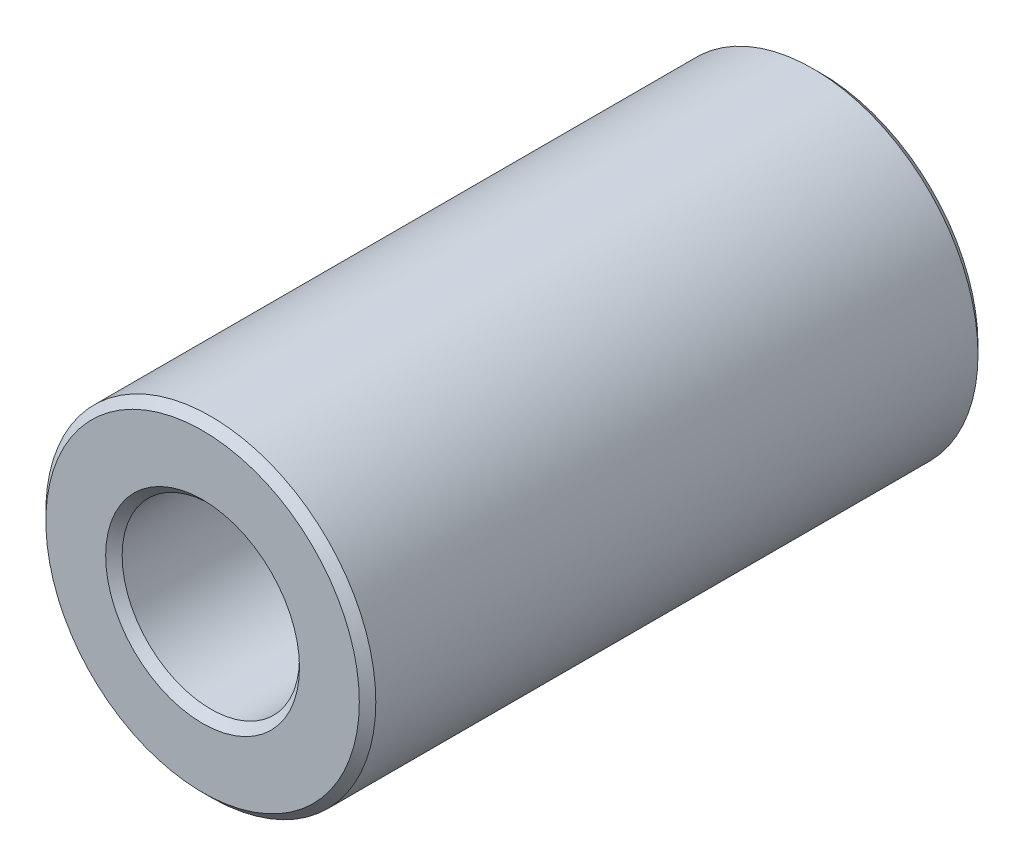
ISO-10303-21;
HEADER;
FILE_DESCRIPTION(('STEP AP214'),'2;1');
FILE_NAME('part.step','',(''),(''),'','','');
FILE_SCHEMA(('AUTOMOTIVE_DESIGN { 1 0 10303 214 1 1 1 1 }'));
ENDSEC;
DATA;
#1=APPLICATION_CONTEXT('core data for automotive mechanical design processes');
#2=APPLICATION_PROTOCOL_DEFINITION('international standard','automotive_design',2000,#1);
#3=PRODUCT_CONTEXT('',#1,'mechanical');
#4=PRODUCT('Part','Part','',(#3));
#5=PRODUCT_RELATED_PRODUCT_CATEGORY('part','',(#4));
#6=PRODUCT_DEFINITION_FORMATION('','',#4);
#7=PRODUCT_DEFINITION_CONTEXT('part definition',#1,'design');
#8=PRODUCT_DEFINITION('design','',#6,#7);
#9=PRODUCT_DEFINITION_SHAPE('','',#8);
#10=(LENGTH_UNIT() NAMED_UNIT(*) SI_UNIT(.MILLI.,.METRE.));
#11=(NAMED_UNIT(*) PLANE_ANGLE_UNIT() SI_UNIT($,.RADIAN.));
#12=(NAMED_UNIT(*) SI_UNIT($,.STERADIAN.) SOLID_ANGLE_UNIT());
#13=UNCERTAINTY_MEASURE_WITH_UNIT(LENGTH_MEASURE(1.E-05),#10,'distance_accuracy_value','');
#14=(GEOMETRIC_REPRESENTATION_CONTEXT(3) GLOBAL_UNCERTAINTY_ASSIGNED_CONTEXT((#13)) GLOBAL_UNIT_ASSIGNED_CONTEXT((#10,
#11,#12)) REPRESENTATION_CONTEXT('',''));
#15=CARTESIAN_POINT('',(0.,0.,0.));
#16=DIRECTION('',(0.,0.,1.));
#17=DIRECTION('',(1.,0.,0.));
#18=AXIS2_PLACEMENT_3D('',#15,#16,#17);
#19=CARTESIAN_POINT('',(0.,0.,7.5));
#20=DIRECTION('',(0.,0.,1.));
#21=DIRECTION('',(1.,0.,0.));
#22=AXIS2_PLACEMENT_3D('',#19,#20,#21);
#23=PLANE('',#22);
#24=CARTESIAN_POINT('',(0.,0.,7.5));
#25=DIRECTION('',(0.,0.,1.));
#26=DIRECTION('',(1.,0.,0.));
#27=AXIS2_PLACEMENT_3D('',#24,#25,#26);
#28=CIRCLE('',#27,2.35);
#29=CARTESIAN_POINT('',(2.35,0.,7.5));
#30=VERTEX_POINT('',#29);
#31=EDGE_CURVE('E10',#30,#30,#28,.F.);
#32=ORIENTED_EDGE('',*,*,#31,.T.);
#33=EDGE_LOOP('',(#32));
#34=FACE_BOUND('',#33,.T.);
#35=CARTESIAN_POINT('',(0.,0.,7.5));
#36=DIRECTION('',(0.,0.,1.));
#37=DIRECTION('',(1.,0.,0.));
#38=AXIS2_PLACEMENT_3D('',#35,#36,#37);
#39=CIRCLE('',#38,3.8);
#40=CARTESIAN_POINT('',(3.8,0.,7.5));
#41=VERTEX_POINT('',#40);
#42=EDGE_CURVE('E45',#41,#41,#39,.T.);
#43=ORIENTED_EDGE('',*,*,#42,.T.);
#44=EDGE_LOOP('',(#43));
#45=FACE_BOUND('',#44,.T.);
#46=ADVANCED_FACE('F37',(#34,#45),#23,.T.);
#47=CARTESIAN_POINT('',(0.,0.,-7.5));
#48=DIRECTION('',(0.,0.,1.));
#49=DIRECTION('',(1.,0.,0.));
#50=AXIS2_PLACEMENT_3D('',#47,#48,#49);
#51=PLANE('',#50);
#52=CARTESIAN_POINT('',(0.,0.,-7.5));
#53=DIRECTION('',(0.,0.,1.));
#54=DIRECTION('',(1.,0.,0.));
#55=AXIS2_PLACEMENT_3D('',#52,#53,#54);
#56=CIRCLE('',#55,3.8);
#57=CARTESIAN_POINT('',(3.8,0.,-7.5));
#58=VERTEX_POINT('',#57);
#59=EDGE_CURVE('E62',#58,#58,#56,.F.);
#60=ORIENTED_EDGE('',*,*,#59,.T.);
#61=EDGE_LOOP('',(#60));
#62=FACE_BOUND('',#61,.T.);
#63=CARTESIAN_POINT('',(0.,0.,-7.5));
#64=DIRECTION('',(0.,0.,1.));
#65=DIRECTION('',(1.,0.,0.));
#66=AXIS2_PLACEMENT_3D('',#63,#64,#65);
#67=CIRCLE('',#66,2.35);
#68=CARTESIAN_POINT('',(2.35,0.,-7.5));
#69=VERTEX_POINT('',#68);
#70=EDGE_CURVE('E65',#69,#69,#67,.T.);
#71=ORIENTED_EDGE('',*,*,#70,.T.);
#72=EDGE_LOOP('',(#71));
#73=FACE_BOUND('',#72,.T.);
#74=ADVANCED_FACE('F89',(#62,#73),#51,.F.);
#75=CARTESIAN_POINT('',(0.,0.,7.5));
#76=DIRECTION('',(0.,0.,-1.));
#77=DIRECTION('',(-1.,0.,0.));
#78=AXIS2_PLACEMENT_3D('',#75,#76,#77);
#79=CYLINDRICAL_SURFACE('',#78,4.);
#80=CARTESIAN_POINT('',(0.,0.,-7.3));
#81=DIRECTION('',(0.,0.,1.));
#82=DIRECTION('',(1.,0.,0.));
#83=AXIS2_PLACEMENT_3D('',#80,#81,#82);
#84=CIRCLE('',#83,4.);
#85=CARTESIAN_POINT('',(4.,0.,-7.3));
#86=VERTEX_POINT('',#85);
#87=EDGE_CURVE('E69',#86,#86,#84,.T.);
#88=ORIENTED_EDGE('',*,*,#87,.T.);
#89=EDGE_LOOP('',(#88));
#90=FACE_BOUND('',#89,.T.);
#91=CARTESIAN_POINT('',(0.,0.,7.3));
#92=DIRECTION('',(0.,0.,1.));
#93=DIRECTION('',(1.,0.,0.));
#94=AXIS2_PLACEMENT_3D('',#91,#92,#93);
#95=CIRCLE('',#94,4.);
#96=CARTESIAN_POINT('',(4.,0.,7.3));
#97=VERTEX_POINT('',#96);
#98=EDGE_CURVE('E73',#97,#97,#95,.F.);
#99=ORIENTED_EDGE('',*,*,#98,.T.);
#100=EDGE_LOOP('',(#99));
#101=FACE_BOUND('',#100,.T.);
#102=ADVANCED_FACE('F78',(#90,#101),#79,.T.);
#103=CARTESIAN_POINT('',(0.,0.,7.5));
#104=DIRECTION('',(0.,0.,-1.));
#105=DIRECTION('',(-1.,0.,0.));
#106=AXIS2_PLACEMENT_3D('',#103,#104,#105);
#107=CYLINDRICAL_SURFACE('',#106,2.15);
#108=CARTESIAN_POINT('',(0.,0.,-7.3));
#109=DIRECTION('',(0.,0.,1.));
#110=DIRECTION('',(1.,0.,0.));
#111=AXIS2_PLACEMENT_3D('',#108,#109,#110);
#112=CIRCLE('',#111,2.15);
#113=CARTESIAN_POINT('',(2.15,0.,-7.3));
#114=VERTEX_POINT('',#113);
#115=EDGE_CURVE('E51',#114,#114,#112,.F.);
#116=ORIENTED_EDGE('',*,*,#115,.T.);
#117=EDGE_LOOP('',(#116));
#118=FACE_BOUND('',#117,.T.);
#119=CARTESIAN_POINT('',(0.,0.,7.3));
#120=DIRECTION('',(0.,0.,1.));
#121=DIRECTION('',(1.,0.,0.));
#122=AXIS2_PLACEMENT_3D('',#119,#120,#121);
#123=CIRCLE('',#122,2.15);
#124=CARTESIAN_POINT('',(2.15,0.,7.3));
#125=VERTEX_POINT('',#124);
#126=EDGE_CURVE('E56',#125,#125,#123,.T.);
#127=ORIENTED_EDGE('',*,*,#126,.T.);
#128=EDGE_LOOP('',(#127));
#129=FACE_BOUND('',#128,.T.);
#130=ADVANCED_FACE('F97',(#118,#129),#107,.F.);
#131=CARTESIAN_POINT('',(0.,0.,-7.3));
#132=DIRECTION('',(0.,0.,1.));
#133=DIRECTION('',(1.,0.,0.));
#134=AXIS2_PLACEMENT_3D('',#131,#132,#133);
#135=CONICAL_SURFACE('',#134,4.,0.785398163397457);
#136=ORIENTED_EDGE('',*,*,#59,.F.);
#137=EDGE_LOOP('',(#136));
#138=FACE_BOUND('',#137,.T.);
#139=ORIENTED_EDGE('',*,*,#87,.F.);
#140=EDGE_LOOP('',(#139));
#141=FACE_BOUND('',#140,.T.);
#142=ADVANCED_FACE('F102',(#138,#141),#135,.T.);
#143=CARTESIAN_POINT('',(0.,0.,-7.5));
#144=DIRECTION('',(0.,0.,-1.));
#145=DIRECTION('',(-1.,0.,0.));
#146=AXIS2_PLACEMENT_3D('',#143,#144,#145);
#147=CONICAL_SURFACE('',#146,2.35,0.785398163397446);
#148=ORIENTED_EDGE('',*,*,#115,.F.);
#149=EDGE_LOOP('',(#148));
#150=FACE_BOUND('',#149,.T.);
#151=ORIENTED_EDGE('',*,*,#70,.F.);
#152=EDGE_LOOP('',(#151));
#153=FACE_BOUND('',#152,.T.);
#154=ADVANCED_FACE('F86',(#150,#153),#147,.F.);
#155=CARTESIAN_POINT('',(0.,0.,7.3));
#156=DIRECTION('',(0.,0.,1.));
#157=DIRECTION('',(1.,0.,0.));
#158=AXIS2_PLACEMENT_3D('',#155,#156,#157);
#159=CONICAL_SURFACE('',#158,2.15,0.785398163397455);
#160=ORIENTED_EDGE('',*,*,#31,.F.);
#161=EDGE_LOOP('',(#160));
#162=FACE_BOUND('',#161,.T.);
#163=ORIENTED_EDGE('',*,*,#126,.F.);
#164=EDGE_LOOP('',(#163));
#165=FACE_BOUND('',#164,.T.);
#166=ADVANCED_FACE('F82',(#162,#165),#159,.F.);
#167=CARTESIAN_POINT('',(0.,0.,7.5));
#168=DIRECTION('',(0.,0.,-1.));
#169=DIRECTION('',(-1.,0.,0.));
#170=AXIS2_PLACEMENT_3D('',#167,#168,#169);
#171=CONICAL_SURFACE('',#170,3.8,0.785398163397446);
#172=ORIENTED_EDGE('',*,*,#98,.F.);
#173=EDGE_LOOP('',(#172));
#174=FACE_BOUND('',#173,.T.);
#175=ORIENTED_EDGE('',*,*,#42,.F.);
#176=EDGE_LOOP('',(#175));
#177=FACE_BOUND('',#176,.T.);
#178=ADVANCED_FACE('F39',(#174,#177),#171,.T.);
#179=CLOSED_SHELL('',(#46,#74,#102,#130,#142,#154,#166,#178));
#180=MANIFOLD_SOLID_BREP('B2',#179);
#181=ADVANCED_BREP_SHAPE_REPRESENTATION('',(#18,#180),#14);
#182=SHAPE_DEFINITION_REPRESENTATION(#9,#181);
ENDSEC;
END-ISO-10303-21;
